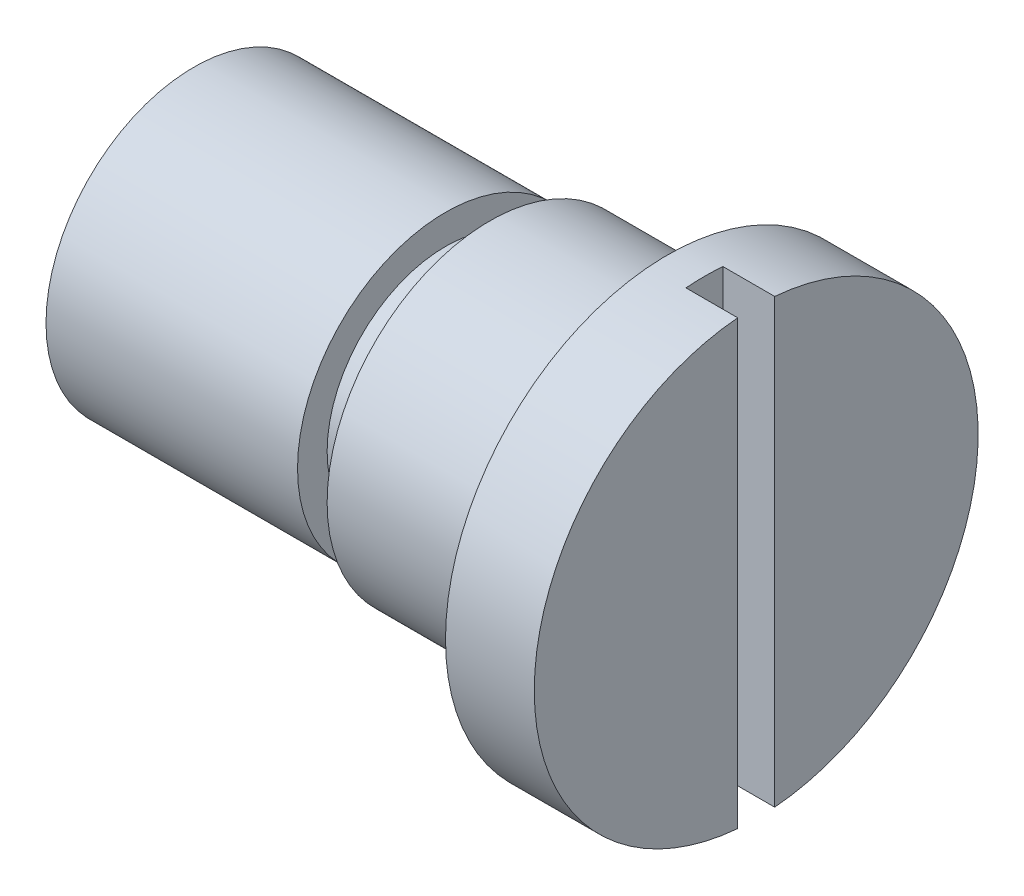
from build123d import *

# Parameters (mm, degrees)
CUT_EXTRUDE1_DEPTH      = 44.520110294
CUT_EXTRUDE1_DEPTH_BACK = 44.520110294
SKETCH2_W               = 3.5
SKETCH2_H               = 2.5


with BuildPart() as part:
    # Sketch1 → Revolve1 (revolve)
    with BuildSketch(Plane.XY, mode=Mode.PRIVATE) as revolve1_sk:
        Polygon((0, 0), (0, 10), (17, 10), (17, 8), (20, 8), (20, 11), (32, 11), (32, 15), (38, 15), (38, 0), align=None)
    revolve(revolve1_sk.sketch.rotate(Axis((-36.467871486, 0, 0), (1, 0, 0)), 90), axis=Axis((-36.467871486, 0, 0), (1, 0, 0)))

    # Sketch2 → Cut-Extrude1 (cut, two sides: drawn at the far end of the back side and taken through both)
    with BuildSketch(Plane(origin=(0, 0, 0), x_dir=(1, 0, 0), z_dir=(0, 1, 0)).offset(-CUT_EXTRUDE1_DEPTH_BACK)):
        with Locations((36.25, 0)):
            Rectangle(SKETCH2_W, SKETCH2_H)
    extrude(amount=CUT_EXTRUDE1_DEPTH + CUT_EXTRUDE1_DEPTH_BACK, mode=Mode.SUBTRACT)


solid = part.part
